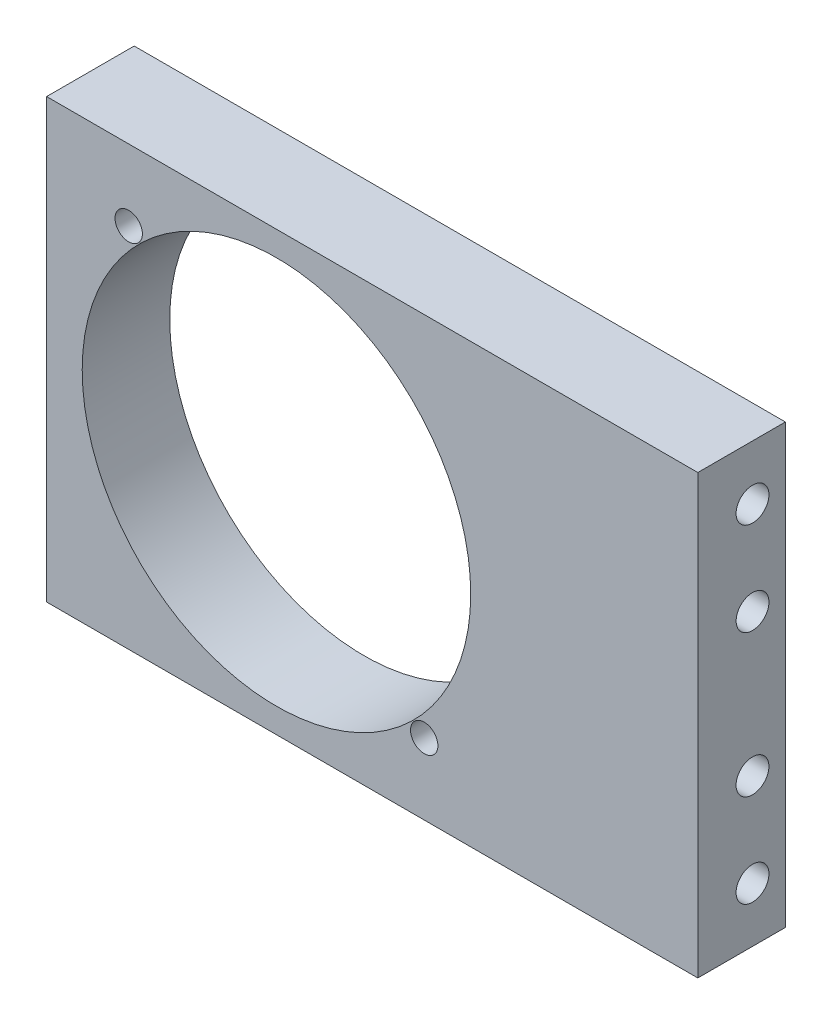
ISO-10303-21;
HEADER;
FILE_DESCRIPTION(('STEP AP214'),'2;1');
FILE_NAME('part.step','',(''),(''),'','','');
FILE_SCHEMA(('AUTOMOTIVE_DESIGN { 1 0 10303 214 1 1 1 1 }'));
ENDSEC;
DATA;
#1=APPLICATION_CONTEXT('core data for automotive mechanical design processes');
#2=APPLICATION_PROTOCOL_DEFINITION('international standard','automotive_design',2000,#1);
#3=PRODUCT_CONTEXT('',#1,'mechanical');
#4=PRODUCT('Part','Part','',(#3));
#5=PRODUCT_RELATED_PRODUCT_CATEGORY('part','',(#4));
#6=PRODUCT_DEFINITION_FORMATION('','',#4);
#7=PRODUCT_DEFINITION_CONTEXT('part definition',#1,'design');
#8=PRODUCT_DEFINITION('design','',#6,#7);
#9=PRODUCT_DEFINITION_SHAPE('','',#8);
#10=(LENGTH_UNIT() NAMED_UNIT(*) SI_UNIT(.MILLI.,.METRE.));
#11=(NAMED_UNIT(*) PLANE_ANGLE_UNIT() SI_UNIT($,.RADIAN.));
#12=(NAMED_UNIT(*) SI_UNIT($,.STERADIAN.) SOLID_ANGLE_UNIT());
#13=UNCERTAINTY_MEASURE_WITH_UNIT(LENGTH_MEASURE(1.E-05),#10,'distance_accuracy_value','');
#14=(GEOMETRIC_REPRESENTATION_CONTEXT(3) GLOBAL_UNCERTAINTY_ASSIGNED_CONTEXT((#13)) GLOBAL_UNIT_ASSIGNED_CONTEXT((#10,
#11,#12)) REPRESENTATION_CONTEXT('',''));
#15=CARTESIAN_POINT('',(0.,0.,0.));
#16=DIRECTION('',(0.,0.,1.));
#17=DIRECTION('',(1.,0.,0.));
#18=AXIS2_PLACEMENT_3D('',#15,#16,#17);
#19=CARTESIAN_POINT('',(0.,0.,8.00000000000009));
#20=DIRECTION('',(0.,0.,-1.00000000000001));
#21=DIRECTION('',(-1.,0.,0.));
#22=AXIS2_PLACEMENT_3D('',#19,#20,#21);
#23=PLANE('',#22);
#24=CARTESIAN_POINT('',(34.5,6.50000000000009,8.00000000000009));
#25=DIRECTION('',(0.,0.,1.));
#26=DIRECTION('',(1.,0.,0.));
#27=AXIS2_PLACEMENT_3D('',#24,#25,#26);
#28=CIRCLE('',#27,1.25);
#29=CARTESIAN_POINT('',(35.75,6.50000000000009,8.00000000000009));
#30=VERTEX_POINT('',#29);
#31=EDGE_CURVE('E416',#30,#30,#28,.T.);
#32=ORIENTED_EDGE('',*,*,#31,.F.);
#33=EDGE_LOOP('',(#32));
#34=FACE_BOUND('',#33,.T.);
#35=CARTESIAN_POINT('',(7.50000000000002,33.5000000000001,8.00000000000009));
#36=DIRECTION('',(0.,0.,1.));
#37=DIRECTION('',(1.,0.,0.));
#38=AXIS2_PLACEMENT_3D('',#35,#36,#37);
#39=CIRCLE('',#38,1.25);
#40=CARTESIAN_POINT('',(8.75000000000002,33.5000000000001,8.00000000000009));
#41=VERTEX_POINT('',#40);
#42=EDGE_CURVE('E99',#41,#41,#39,.T.);
#43=ORIENTED_EDGE('',*,*,#42,.F.);
#44=EDGE_LOOP('',(#43));
#45=FACE_BOUND('',#44,.T.);
#46=DIRECTION('',(0.,-1.00000000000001,0.));
#47=VECTOR('',#46,1.);
#48=CARTESIAN_POINT('',(0.,0.,8.00000000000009));
#49=LINE('',#48,#47);
#50=CARTESIAN_POINT('',(0.,40.0000000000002,8.00000000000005));
#51=VERTEX_POINT('',#50);
#52=CARTESIAN_POINT('',(0.,0.,8.00000000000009));
#53=VERTEX_POINT('',#52);
#54=EDGE_CURVE('E133',#51,#53,#49,.T.);
#55=ORIENTED_EDGE('',*,*,#54,.T.);
#56=DIRECTION('',(1.,0.,0.));
#57=VECTOR('',#56,1.);
#58=CARTESIAN_POINT('',(0.,0.,8.00000000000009));
#59=LINE('',#58,#57);
#60=CARTESIAN_POINT('',(59.5,0.,8.00000000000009));
#61=VERTEX_POINT('',#60);
#62=EDGE_CURVE('E135',#53,#61,#59,.T.);
#63=ORIENTED_EDGE('',*,*,#62,.T.);
#64=DIRECTION('',(0.,1.00000000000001,0.));
#65=VECTOR('',#64,1.);
#66=CARTESIAN_POINT('',(59.5,0.,8.00000000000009));
#67=LINE('',#66,#65);
#68=CARTESIAN_POINT('',(59.5,40.0000000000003,8.00000000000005));
#69=VERTEX_POINT('',#68);
#70=EDGE_CURVE('E137',#61,#69,#67,.T.);
#71=ORIENTED_EDGE('',*,*,#70,.T.);
#72=DIRECTION('',(-1.,0.,0.));
#73=VECTOR('',#72,1.);
#74=CARTESIAN_POINT('',(0.,40.0000000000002,8.00000000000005));
#75=LINE('',#74,#73);
#76=EDGE_CURVE('E49',#69,#51,#75,.T.);
#77=ORIENTED_EDGE('',*,*,#76,.T.);
#78=EDGE_LOOP('',(#55,#63,#71,#77));
#79=FACE_BOUND('',#78,.T.);
#80=CARTESIAN_POINT('',(21.,20.0000000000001,8.00000000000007));
#81=DIRECTION('',(0.,0.,1.00000000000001));
#82=DIRECTION('',(1.,0.,0.));
#83=AXIS2_PLACEMENT_3D('',#80,#81,#82);
#84=CIRCLE('',#83,17.75);
#85=CARTESIAN_POINT('',(38.75,20.0000000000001,8.00000000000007));
#86=VERTEX_POINT('',#85);
#87=EDGE_CURVE('E121',#86,#86,#84,.T.);
#88=ORIENTED_EDGE('',*,*,#87,.F.);
#89=EDGE_LOOP('',(#88));
#90=FACE_BOUND('',#89,.T.);
#91=ADVANCED_FACE('F27',(#34,#45,#79,#90),#23,.F.);
#92=CARTESIAN_POINT('',(0.,0.,0.));
#93=DIRECTION('',(0.,0.,-1.00000000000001));
#94=DIRECTION('',(-1.,0.,0.));
#95=AXIS2_PLACEMENT_3D('',#92,#93,#94);
#96=PLANE('',#95);
#97=CARTESIAN_POINT('',(34.5,6.50000000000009,0.));
#98=DIRECTION('',(0.,0.,-1.00000000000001));
#99=DIRECTION('',(-1.,0.,0.));
#100=AXIS2_PLACEMENT_3D('',#97,#98,#99);
#101=CIRCLE('',#100,1.25);
#102=CARTESIAN_POINT('',(33.25,6.50000000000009,0.));
#103=VERTEX_POINT('',#102);
#104=EDGE_CURVE('E31',#103,#103,#101,.T.);
#105=ORIENTED_EDGE('',*,*,#104,.F.);
#106=EDGE_LOOP('',(#105));
#107=FACE_BOUND('',#106,.T.);
#108=CARTESIAN_POINT('',(7.50000000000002,33.5000000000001,0.));
#109=DIRECTION('',(0.,0.,-1.00000000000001));
#110=DIRECTION('',(-1.,0.,0.));
#111=AXIS2_PLACEMENT_3D('',#108,#109,#110);
#112=CIRCLE('',#111,1.25);
#113=CARTESIAN_POINT('',(6.25000000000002,33.5000000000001,0.));
#114=VERTEX_POINT('',#113);
#115=EDGE_CURVE('E98',#114,#114,#112,.T.);
#116=ORIENTED_EDGE('',*,*,#115,.F.);
#117=EDGE_LOOP('',(#116));
#118=FACE_BOUND('',#117,.T.);
#119=DIRECTION('',(0.,-1.00000000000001,0.));
#120=VECTOR('',#119,1.);
#121=CARTESIAN_POINT('',(0.,0.,0.));
#122=LINE('',#121,#120);
#123=CARTESIAN_POINT('',(0.,40.0000000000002,0.));
#124=VERTEX_POINT('',#123);
#125=CARTESIAN_POINT('',(0.,0.,0.));
#126=VERTEX_POINT('',#125);
#127=EDGE_CURVE('E124',#124,#126,#122,.T.);
#128=ORIENTED_EDGE('',*,*,#127,.F.);
#129=DIRECTION('',(-1.,0.,0.));
#130=VECTOR('',#129,1.);
#131=CARTESIAN_POINT('',(0.,40.0000000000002,0.));
#132=LINE('',#131,#130);
#133=CARTESIAN_POINT('',(59.5,40.0000000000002,0.));
#134=VERTEX_POINT('',#133);
#135=EDGE_CURVE('E131',#134,#124,#132,.T.);
#136=ORIENTED_EDGE('',*,*,#135,.F.);
#137=DIRECTION('',(0.,1.00000000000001,0.));
#138=VECTOR('',#137,1.);
#139=CARTESIAN_POINT('',(59.5,0.,0.));
#140=LINE('',#139,#138);
#141=CARTESIAN_POINT('',(59.5,0.,0.));
#142=VERTEX_POINT('',#141);
#143=EDGE_CURVE('E129',#142,#134,#140,.T.);
#144=ORIENTED_EDGE('',*,*,#143,.F.);
#145=DIRECTION('',(1.,0.,0.));
#146=VECTOR('',#145,1.);
#147=CARTESIAN_POINT('',(0.,0.,0.));
#148=LINE('',#147,#146);
#149=EDGE_CURVE('E127',#126,#142,#148,.T.);
#150=ORIENTED_EDGE('',*,*,#149,.F.);
#151=EDGE_LOOP('',(#128,#136,#144,#150));
#152=FACE_BOUND('',#151,.T.);
#153=CARTESIAN_POINT('',(21.,20.0000000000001,0.));
#154=DIRECTION('',(0.,0.,1.00000000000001));
#155=DIRECTION('',(1.,0.,0.));
#156=AXIS2_PLACEMENT_3D('',#153,#154,#155);
#157=CIRCLE('',#156,17.75);
#158=CARTESIAN_POINT('',(38.75,20.0000000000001,0.));
#159=VERTEX_POINT('',#158);
#160=EDGE_CURVE('E118',#159,#159,#157,.T.);
#161=ORIENTED_EDGE('',*,*,#160,.T.);
#162=EDGE_LOOP('',(#161));
#163=FACE_BOUND('',#162,.T.);
#164=ADVANCED_FACE('F190',(#107,#118,#152,#163),#96,.T.);
#165=CARTESIAN_POINT('',(0.,0.,8.00000000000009));
#166=DIRECTION('',(1.,0.,0.));
#167=DIRECTION('',(0.,0.,-1.00000000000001));
#168=AXIS2_PLACEMENT_3D('',#165,#166,#167);
#169=PLANE('',#168);
#170=CARTESIAN_POINT('',(0.,5.,3.00000000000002));
#171=DIRECTION('',(-1.,0.,0.));
#172=DIRECTION('',(0.,0.,1.00000000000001));
#173=AXIS2_PLACEMENT_3D('',#170,#171,#172);
#174=CIRCLE('',#173,1.5);
#175=CARTESIAN_POINT('',(0.,5.,4.50000000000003));
#176=VERTEX_POINT('',#175);
#177=EDGE_CURVE('E103',#176,#176,#174,.T.);
#178=ORIENTED_EDGE('',*,*,#177,.F.);
#179=EDGE_LOOP('',(#178));
#180=FACE_BOUND('',#179,.T.);
#181=CARTESIAN_POINT('',(0.,35.0000000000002,3.));
#182=DIRECTION('',(-1.,0.,0.));
#183=DIRECTION('',(0.,0.,1.00000000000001));
#184=AXIS2_PLACEMENT_3D('',#181,#182,#183);
#185=CIRCLE('',#184,1.5);
#186=CARTESIAN_POINT('',(0.,35.0000000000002,4.50000000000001));
#187=VERTEX_POINT('',#186);
#188=EDGE_CURVE('E115',#187,#187,#185,.T.);
#189=ORIENTED_EDGE('',*,*,#188,.F.);
#190=EDGE_LOOP('',(#189));
#191=FACE_BOUND('',#190,.T.);
#192=ORIENTED_EDGE('',*,*,#127,.T.);
#193=DIRECTION('',(0.,0.,-1.00000000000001));
#194=VECTOR('',#193,1.);
#195=CARTESIAN_POINT('',(0.,0.,8.00000000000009));
#196=LINE('',#195,#194);
#197=EDGE_CURVE('E36',#53,#126,#196,.T.);
#198=ORIENTED_EDGE('',*,*,#197,.F.);
#199=ORIENTED_EDGE('',*,*,#54,.F.);
#200=DIRECTION('',(0.,0.,-1.00000000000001));
#201=VECTOR('',#200,1.);
#202=CARTESIAN_POINT('',(0.,40.0000000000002,8.00000000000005));
#203=LINE('',#202,#201);
#204=EDGE_CURVE('E140',#51,#124,#203,.T.);
#205=ORIENTED_EDGE('',*,*,#204,.T.);
#206=EDGE_LOOP('',(#192,#198,#199,#205));
#207=FACE_BOUND('',#206,.T.);
#208=ADVANCED_FACE('F29',(#180,#191,#207),#169,.F.);
#209=CARTESIAN_POINT('',(0.,0.,8.00000000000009));
#210=DIRECTION('',(0.,1.00000000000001,0.));
#211=DIRECTION('',(0.,0.,1.00000000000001));
#212=AXIS2_PLACEMENT_3D('',#209,#210,#211);
#213=PLANE('',#212);
#214=ORIENTED_EDGE('',*,*,#149,.T.);
#215=DIRECTION('',(0.,0.,-1.00000000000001));
#216=VECTOR('',#215,1.);
#217=CARTESIAN_POINT('',(59.5,0.,8.00000000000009));
#218=LINE('',#217,#216);
#219=EDGE_CURVE('E146',#61,#142,#218,.T.);
#220=ORIENTED_EDGE('',*,*,#219,.F.);
#221=ORIENTED_EDGE('',*,*,#62,.F.);
#222=ORIENTED_EDGE('',*,*,#197,.T.);
#223=EDGE_LOOP('',(#214,#220,#221,#222));
#224=FACE_BOUND('',#223,.T.);
#225=ADVANCED_FACE('F202',(#224),#213,.F.);
#226=CARTESIAN_POINT('',(59.5,0.,8.00000000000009));
#227=DIRECTION('',(-1.,0.,0.));
#228=DIRECTION('',(0.,0.,1.00000000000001));
#229=AXIS2_PLACEMENT_3D('',#226,#227,#228);
#230=PLANE('',#229);
#231=CARTESIAN_POINT('',(59.5,13.4999987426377,3.0046233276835));
#232=DIRECTION('',(1.,0.,0.));
#233=DIRECTION('',(0.,0.,-1.00000000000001));
#234=AXIS2_PLACEMENT_3D('',#231,#232,#233);
#235=CIRCLE('',#234,1.49999999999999);
#236=CARTESIAN_POINT('',(59.5,13.4999987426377,1.5046233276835));
#237=VERTEX_POINT('',#236);
#238=EDGE_CURVE('E326',#237,#237,#235,.T.);
#239=ORIENTED_EDGE('',*,*,#238,.F.);
#240=EDGE_LOOP('',(#239));
#241=FACE_BOUND('',#240,.T.);
#242=CARTESIAN_POINT('',(59.5,26.5000000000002,3.00000000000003));
#243=DIRECTION('',(1.,0.,0.));
#244=DIRECTION('',(0.,0.,-1.00000000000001));
#245=AXIS2_PLACEMENT_3D('',#242,#243,#244);
#246=CIRCLE('',#245,1.49999999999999);
#247=CARTESIAN_POINT('',(59.5,26.5000000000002,1.50000000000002));
#248=VERTEX_POINT('',#247);
#249=EDGE_CURVE('E340',#248,#248,#246,.T.);
#250=ORIENTED_EDGE('',*,*,#249,.F.);
#251=EDGE_LOOP('',(#250));
#252=FACE_BOUND('',#251,.T.);
#253=CARTESIAN_POINT('',(59.5,35.0000000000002,3.));
#254=DIRECTION('',(-1.,0.,0.));
#255=DIRECTION('',(0.,0.,1.00000000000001));
#256=AXIS2_PLACEMENT_3D('',#253,#254,#255);
#257=CIRCLE('',#256,1.5);
#258=CARTESIAN_POINT('',(59.5,35.0000000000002,4.50000000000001));
#259=VERTEX_POINT('',#258);
#260=EDGE_CURVE('E343',#259,#259,#257,.T.);
#261=ORIENTED_EDGE('',*,*,#260,.T.);
#262=EDGE_LOOP('',(#261));
#263=FACE_BOUND('',#262,.T.);
#264=CARTESIAN_POINT('',(59.5,5.,3.00000000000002));
#265=DIRECTION('',(-1.,0.,0.));
#266=DIRECTION('',(0.,0.,1.00000000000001));
#267=AXIS2_PLACEMENT_3D('',#264,#265,#266);
#268=CIRCLE('',#267,1.5);
#269=CARTESIAN_POINT('',(59.5,5.,4.50000000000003));
#270=VERTEX_POINT('',#269);
#271=EDGE_CURVE('E355',#270,#270,#268,.T.);
#272=ORIENTED_EDGE('',*,*,#271,.T.);
#273=EDGE_LOOP('',(#272));
#274=FACE_BOUND('',#273,.T.);
#275=ORIENTED_EDGE('',*,*,#143,.T.);
#276=DIRECTION('',(0.,0.,-1.00000000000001));
#277=VECTOR('',#276,1.);
#278=CARTESIAN_POINT('',(59.5,40.0000000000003,8.00000000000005));
#279=LINE('',#278,#277);
#280=EDGE_CURVE('E143',#69,#134,#279,.T.);
#281=ORIENTED_EDGE('',*,*,#280,.F.);
#282=ORIENTED_EDGE('',*,*,#70,.F.);
#283=ORIENTED_EDGE('',*,*,#219,.T.);
#284=EDGE_LOOP('',(#275,#281,#282,#283));
#285=FACE_BOUND('',#284,.T.);
#286=ADVANCED_FACE('F199',(#241,#252,#263,#274,#285),#230,.F.);
#287=CARTESIAN_POINT('',(0.,40.0000000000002,8.00000000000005));
#288=DIRECTION('',(0.,-1.00000000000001,0.));
#289=DIRECTION('',(1.,0.,0.));
#290=AXIS2_PLACEMENT_3D('',#287,#288,#289);
#291=PLANE('',#290);
#292=ORIENTED_EDGE('',*,*,#135,.T.);
#293=ORIENTED_EDGE('',*,*,#204,.F.);
#294=ORIENTED_EDGE('',*,*,#76,.F.);
#295=ORIENTED_EDGE('',*,*,#280,.T.);
#296=EDGE_LOOP('',(#292,#293,#294,#295));
#297=FACE_BOUND('',#296,.T.);
#298=ADVANCED_FACE('F188',(#297),#291,.F.);
#299=CARTESIAN_POINT('',(21.,20.0000000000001,8.00000000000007));
#300=DIRECTION('',(0.,0.,-1.00000000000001));
#301=DIRECTION('',(-1.,0.,0.));
#302=AXIS2_PLACEMENT_3D('',#299,#300,#301);
#303=CYLINDRICAL_SURFACE('',#302,17.75);
#304=ORIENTED_EDGE('',*,*,#87,.T.);
#305=EDGE_LOOP('',(#304));
#306=FACE_BOUND('',#305,.T.);
#307=ORIENTED_EDGE('',*,*,#160,.F.);
#308=EDGE_LOOP('',(#307));
#309=FACE_BOUND('',#308,.T.);
#310=ADVANCED_FACE('F184',(#306,#309),#303,.F.);
#311=CARTESIAN_POINT('',(0.,35.0000000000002,3.));
#312=DIRECTION('',(-1.,0.,0.));
#313=DIRECTION('',(0.,0.,1.00000000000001));
#314=AXIS2_PLACEMENT_3D('',#311,#312,#313);
#315=CYLINDRICAL_SURFACE('',#314,1.5);
#316=CARTESIAN_POINT('',(5.,35.0000000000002,3.));
#317=DIRECTION('',(-1.,0.,0.));
#318=DIRECTION('',(0.,0.,1.00000000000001));
#319=AXIS2_PLACEMENT_3D('',#316,#317,#318);
#320=CIRCLE('',#319,1.5);
#321=CARTESIAN_POINT('',(5.,35.0000000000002,4.50000000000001));
#322=VERTEX_POINT('',#321);
#323=EDGE_CURVE('E106',#322,#322,#320,.T.);
#324=ORIENTED_EDGE('',*,*,#323,.F.);
#325=EDGE_LOOP('',(#324));
#326=FACE_BOUND('',#325,.T.);
#327=ORIENTED_EDGE('',*,*,#188,.T.);
#328=EDGE_LOOP('',(#327));
#329=FACE_BOUND('',#328,.T.);
#330=ADVANCED_FACE('F180',(#326,#329),#315,.F.);
#331=CARTESIAN_POINT('',(5.,36.2500000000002,3.00000000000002));
#332=DIRECTION('',(1.,0.,0.));
#333=DIRECTION('',(0.,0.,-1.00000000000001));
#334=AXIS2_PLACEMENT_3D('',#331,#332,#333);
#335=PLANE('',#334);
#336=CARTESIAN_POINT('',(5.,35.0000000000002,3.));
#337=DIRECTION('',(-1.,0.,0.));
#338=DIRECTION('',(0.,0.,1.00000000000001));
#339=AXIS2_PLACEMENT_3D('',#336,#337,#338);
#340=CIRCLE('',#339,1.25);
#341=CARTESIAN_POINT('',(5.,35.0000000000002,4.25000000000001));
#342=VERTEX_POINT('',#341);
#343=EDGE_CURVE('E102',#342,#342,#340,.T.);
#344=ORIENTED_EDGE('',*,*,#343,.F.);
#345=EDGE_LOOP('',(#344));
#346=FACE_BOUND('',#345,.T.);
#347=ORIENTED_EDGE('',*,*,#323,.T.);
#348=EDGE_LOOP('',(#347));
#349=FACE_BOUND('',#348,.T.);
#350=ADVANCED_FACE('F177',(#346,#349),#335,.F.);
#351=CARTESIAN_POINT('',(0.,35.0000000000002,3.));
#352=DIRECTION('',(-1.,0.,0.));
#353=DIRECTION('',(0.,0.,1.00000000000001));
#354=AXIS2_PLACEMENT_3D('',#351,#352,#353);
#355=CYLINDRICAL_SURFACE('',#354,1.25);
#356=CARTESIAN_POINT('',(7.49999999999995,35.0000000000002,3.));
#357=DIRECTION('',(-1.,0.,0.));
#358=DIRECTION('',(0.,0.,1.00000000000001));
#359=AXIS2_PLACEMENT_3D('',#356,#357,#358);
#360=CIRCLE('',#359,1.25);
#361=CARTESIAN_POINT('',(7.49999999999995,34.7500000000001,4.22474487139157));
#362=VERTEX_POINT('',#361);
#363=CARTESIAN_POINT('',(7.49999999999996,34.7500000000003,1.77525512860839));
#364=VERTEX_POINT('',#363);
#365=EDGE_CURVE('E97',#362,#364,#360,.T.);
#366=ORIENTED_EDGE('',*,*,#365,.F.);
#367=CARTESIAN_POINT('',(7.49999999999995,34.7500000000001,4.22474487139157));
#368=CARTESIAN_POINT('',(7.46650399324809,34.750003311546,4.22473581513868));
#369=CARTESIAN_POINT('',(7.43300870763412,34.7486536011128,4.22446977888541));
#370=CARTESIAN_POINT('',(7.36623995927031,34.7432731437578,4.22335815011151));
#371=CARTESIAN_POINT('',(7.33296652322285,34.7392420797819,4.22251248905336));
#372=CARTESIAN_POINT('',(7.26677348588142,34.728508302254,4.22017257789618));
#373=CARTESIAN_POINT('',(7.23385519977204,34.7217978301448,4.21867644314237));
#374=CARTESIAN_POINT('',(7.16871640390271,34.7057687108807,4.2149052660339));
#375=CARTESIAN_POINT('',(7.13649586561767,34.6964501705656,4.21263025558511));
#376=CARTESIAN_POINT('',(7.04111563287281,34.6646491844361,4.20437957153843));
#377=CARTESIAN_POINT('',(6.9792945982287,34.6383307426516,4.196979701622));
#378=CARTESIAN_POINT('',(6.86146135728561,34.5766530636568,4.17657240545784));
#379=CARTESIAN_POINT('',(6.80543988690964,34.5413085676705,4.16357409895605));
#380=CARTESIAN_POINT('',(6.70378964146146,34.4655833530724,4.13071051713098));
#381=CARTESIAN_POINT('',(6.65777287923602,34.4255582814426,4.11123576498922));
#382=CARTESIAN_POINT('',(6.57415937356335,34.3419078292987,4.06381831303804));
#383=CARTESIAN_POINT('',(6.53655445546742,34.2982860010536,4.03588389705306));
#384=CARTESIAN_POINT('',(6.47430255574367,34.2160946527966,3.97483139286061));
#385=CARTESIAN_POINT('',(6.448649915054,34.1775366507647,3.94271461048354));
#386=CARTESIAN_POINT('',(6.4040490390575,34.1027360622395,3.87182060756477));
#387=CARTESIAN_POINT('',(6.38510231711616,34.0664939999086,3.83304188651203));
#388=CARTESIAN_POINT('',(6.3532557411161,33.9988584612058,3.75035302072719));
#389=CARTESIAN_POINT('',(6.34027075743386,33.9674013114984,3.70652707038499));
#390=CARTESIAN_POINT('',(6.31877299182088,33.9100517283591,3.61437958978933));
#391=CARTESIAN_POINT('',(6.31026181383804,33.8841612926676,3.56605645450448));
#392=CARTESIAN_POINT('',(6.29583428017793,33.8364157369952,3.46071751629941));
#393=CARTESIAN_POINT('',(6.290290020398,33.815282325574,3.40332375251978));
#394=CARTESIAN_POINT('',(6.28200757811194,33.7815937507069,3.285875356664));
#395=CARTESIAN_POINT('',(6.2792706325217,33.7690423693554,3.22581956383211));
#396=CARTESIAN_POINT('',(6.27565084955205,33.7521029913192,3.09869967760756));
#397=CARTESIAN_POINT('',(6.274968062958,33.748600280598,3.03151033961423));
#398=CARTESIAN_POINT('',(6.27574856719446,33.7524096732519,2.89743509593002));
#399=CARTESIAN_POINT('',(6.27721259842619,33.7597255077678,2.83054930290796));
#400=CARTESIAN_POINT('',(6.28291581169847,33.7852761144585,2.6972370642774));
#401=CARTESIAN_POINT('',(6.28722440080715,33.8037829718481,2.63086524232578));
#402=CARTESIAN_POINT('',(6.30012115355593,33.851273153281,2.50239475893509));
#403=CARTESIAN_POINT('',(6.30870892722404,33.8802555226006,2.44029570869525));
#404=CARTESIAN_POINT('',(6.33183332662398,33.9461590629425,2.32457986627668));
#405=CARTESIAN_POINT('',(6.34615057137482,33.9827658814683,2.27074185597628));
#406=CARTESIAN_POINT('',(6.38274484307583,34.0622623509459,2.17102663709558));
#407=CARTESIAN_POINT('',(6.4050101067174,34.1051426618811,2.12513781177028));
#408=CARTESIAN_POINT('',(6.45590332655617,34.1888220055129,2.04743551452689));
#409=CARTESIAN_POINT('',(6.4835192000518,34.2293027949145,2.01461465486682));
#410=CARTESIAN_POINT('',(6.54641322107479,34.3097988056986,1.95664783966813));
#411=CARTESIAN_POINT('',(6.58169003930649,34.3498141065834,1.93150055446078));
#412=CARTESIAN_POINT('',(6.65656224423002,34.4239556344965,1.88988343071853));
#413=CARTESIAN_POINT('',(6.69567771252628,34.458298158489,1.87292675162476));
#414=CARTESIAN_POINT('',(6.77911396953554,34.5225449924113,1.84424182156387));
#415=CARTESIAN_POINT('',(6.82343648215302,34.5524478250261,1.83251530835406));
#416=CARTESIAN_POINT('',(6.91960260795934,34.6085854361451,1.81246033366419));
#417=CARTESIAN_POINT('',(6.97175905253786,34.6343932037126,1.80444235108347));
#418=CARTESIAN_POINT('',(7.07951886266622,34.6785975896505,1.79180675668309));
#419=CARTESIAN_POINT('',(7.1351239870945,34.6969903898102,1.78719089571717));
#420=CARTESIAN_POINT('',(7.24209796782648,34.7242057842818,1.78073402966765));
#421=CARTESIAN_POINT('',(7.29323756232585,34.7338736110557,1.7786388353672));
#422=CARTESIAN_POINT('',(7.37050713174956,34.7435455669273,1.77658652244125));
#423=CARTESIAN_POINT('',(7.39634106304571,34.7459645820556,1.77608413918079));
#424=CARTESIAN_POINT('',(7.4481145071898,34.7491919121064,1.77541978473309));
#425=CARTESIAN_POINT('',(7.47405402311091,34.7500001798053,1.7752578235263));
#426=CARTESIAN_POINT('',(7.49999999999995,34.7500000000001,1.77525512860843));
#427=B_SPLINE_CURVE_WITH_KNOTS('',3,(#367,#368,#369,#370,#371,#372,#373,#374,#375,#376,#377,
#378,#379,#380,#381,#382,#383,#384,#385,#386,#387,#388,#389,#390,#391,#392,#393,#394,#395,#396,
#397,#398,#399,#400,#401,#402,#403,#404,#405,#406,#407,#408,#409,#410,#411,#412,#413,#414,#415,
#416,#417,#418,#419,#420,#421,#422,#423,#424,#425,#426),.UNSPECIFIED.,.F.,.F.,(4,2,2,2,2,2,2,2,
2,2,2,2,2,2,2,2,2,2,2,2,2,2,2,2,2,2,2,2,2,4),(0.,0.100458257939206,0.200928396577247,
0.301691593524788,0.402450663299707,0.604140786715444,0.805503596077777,0.996437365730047,
1.18718477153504,1.35541307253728,1.52367931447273,1.68946177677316,1.85530363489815,
2.03877796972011,2.22233310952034,2.42326485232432,2.62426590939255,2.83036218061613,
3.03643967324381,3.2352839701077,3.43383518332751,3.60979711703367,3.78572854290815,
3.94925444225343,4.11283463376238,4.28835395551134,4.46396354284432,4.61977278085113,
4.6975823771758,4.77539425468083),.UNSPECIFIED.);
#428=EDGE_CURVE('E42',#362,#364,#427,.T.);
#429=ORIENTED_EDGE('',*,*,#428,.T.);
#430=EDGE_LOOP('',(#366,#429));
#431=FACE_BOUND('',#430,.T.);
#432=ORIENTED_EDGE('',*,*,#343,.T.);
#433=EDGE_LOOP('',(#432));
#434=FACE_BOUND('',#433,.T.);
#435=ADVANCED_FACE('F95',(#431,#434),#355,.F.);
#436=CARTESIAN_POINT('',(7.49999999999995,35.0000000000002,3.));
#437=DIRECTION('',(-1.,0.,0.));
#438=DIRECTION('',(0.,0.,1.00000000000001));
#439=AXIS2_PLACEMENT_3D('',#436,#437,#438);
#440=CONICAL_SURFACE('',#439,1.25,1.0471975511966);
#441=CARTESIAN_POINT('',(8.22168783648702,35.0000000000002,3.));
#442=VERTEX_POINT('',#441);
#443=VERTEX_LOOP('',#442);
#444=FACE_BOUND('',#443,.T.);
#445=ORIENTED_EDGE('',*,*,#365,.T.);
#446=CARTESIAN_POINT('',(7.42763121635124,34.747903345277,1.64795524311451));
#447=CARTESIAN_POINT('',(7.45993917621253,34.7497821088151,1.70457335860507));
#448=CARTESIAN_POINT('',(7.49216370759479,34.7503869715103,1.76127895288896));
#449=CARTESIAN_POINT('',(7.55620829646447,34.7491450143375,1.87490263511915));
#450=CARTESIAN_POINT('',(7.58802829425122,34.7472978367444,1.93182075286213));
#451=CARTESIAN_POINT('',(7.65123686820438,34.7412262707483,2.04628935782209));
#452=CARTESIAN_POINT('',(7.68262087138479,34.7369853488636,2.1038414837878));
#453=CARTESIAN_POINT('',(7.74425771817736,34.7262999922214,2.21933523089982));
#454=CARTESIAN_POINT('',(7.77451077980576,34.7198559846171,2.27727677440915));
#455=CARTESIAN_POINT('',(7.8203043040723,34.7083867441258,2.3686780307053));
#456=CARTESIAN_POINT('',(7.83653888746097,34.7039569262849,2.40186531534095));
#457=CARTESIAN_POINT('',(7.8680558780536,34.6946981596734,2.46863214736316));
#458=CARTESIAN_POINT('',(7.88333838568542,34.6898692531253,2.50221165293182));
#459=CARTESIAN_POINT('',(7.91251122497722,34.6800723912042,2.56994327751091));
#460=CARTESIAN_POINT('',(7.92640219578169,34.6751045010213,2.60409512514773));
#461=CARTESIAN_POINT('',(7.95211863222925,34.6654512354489,2.67319037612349));
#462=CARTESIAN_POINT('',(7.9639451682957,34.6607657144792,2.70813335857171));
#463=CARTESIAN_POINT('',(7.98727956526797,34.6511990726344,2.78857101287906));
#464=CARTESIAN_POINT('',(7.99786349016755,34.6465982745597,2.83439712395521));
#465=CARTESIAN_POINT('',(8.00811657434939,34.6420733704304,2.90393877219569));
#466=CARTESIAN_POINT('',(8.01059827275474,34.6409608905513,2.92715908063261));
#467=CARTESIAN_POINT('',(8.01351708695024,34.6396503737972,2.97375773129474));
#468=CARTESIAN_POINT('',(8.01395439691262,34.6394522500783,2.99713605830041));
#469=CARTESIAN_POINT('',(8.01274246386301,34.6399980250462,3.04375150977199));
#470=CARTESIAN_POINT('',(8.01109977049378,34.6407389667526,3.06698884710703));
#471=CARTESIAN_POINT('',(8.00588960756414,34.6430588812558,3.11320631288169));
#472=CARTESIAN_POINT('',(8.00232136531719,34.6446381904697,3.13618633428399));
#473=CARTESIAN_POINT('',(7.99345239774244,34.648489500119,3.18220677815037));
#474=CARTESIAN_POINT('',(7.98811945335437,34.6507743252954,3.20523974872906));
#475=CARTESIAN_POINT('',(7.9760666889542,34.6558129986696,3.25088159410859));
#476=CARTESIAN_POINT('',(7.96934674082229,34.6585668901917,3.27349042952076));
#477=CARTESIAN_POINT('',(7.94604504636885,34.6678339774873,3.34546019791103));
#478=CARTESIAN_POINT('',(7.92737403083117,34.6748617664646,3.39406847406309));
#479=CARTESIAN_POINT('',(7.88706284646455,34.6887567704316,3.49007553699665));
#480=CARTESIAN_POINT('',(7.8654186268,34.6956237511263,3.5374725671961));
#481=CARTESIAN_POINT('',(7.82030423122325,34.7084944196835,3.63173151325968));
#482=CARTESIAN_POINT('',(7.79682744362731,34.7144947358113,3.67859071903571));
#483=CARTESIAN_POINT('',(7.74880379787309,34.7252360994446,3.77190356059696));
#484=CARTESIAN_POINT('',(7.72425686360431,34.7299770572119,3.8183571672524));
#485=CARTESIAN_POINT('',(7.67735065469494,34.7375560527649,3.9056864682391));
#486=CARTESIAN_POINT('',(7.65506511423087,34.7405503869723,3.94658826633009));
#487=CARTESIAN_POINT('',(7.61012555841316,34.7453446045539,4.0282676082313));
#488=CARTESIAN_POINT('',(7.58747148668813,34.7471443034,4.06904513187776));
#489=CARTESIAN_POINT('',(7.54204729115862,34.7494984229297,4.15025459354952));
#490=CARTESIAN_POINT('',(7.51927865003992,34.7500601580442,4.19068714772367));
#491=CARTESIAN_POINT('',(7.47356788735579,34.7499296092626,4.27144487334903));
#492=CARTESIAN_POINT('',(7.45062578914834,34.7492374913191,4.31177005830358));
#493=CARTESIAN_POINT('',(7.42763121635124,34.747903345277,4.35204475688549));
#494=B_SPLINE_CURVE_WITH_KNOTS('',3,(#446,#447,#448,#449,#450,#451,#452,#453,#454,#455,#456,
#457,#458,#459,#460,#461,#462,#463,#464,#465,#466,#467,#468,#469,#470,#471,#472,#473,#474,#475,
#476,#477,#478,#479,#480,#481,#482,#483,#484,#485,#486,#487,#488,#489,#490,#491,#492,#493),
.UNSPECIFIED.,.F.,.F.,(4,2,2,2,2,2,2,2,2,2,2,2,2,2,2,2,2,2,2,2,2,2,2,4),(0.,0.195628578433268,
0.391285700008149,0.588311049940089,0.78529822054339,0.896915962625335,1.00852191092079,
1.1200763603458,1.23157279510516,1.37276723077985,1.44280909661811,1.51284430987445,
1.58265953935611,1.65250280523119,1.72369892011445,1.79490161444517,1.95231326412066,
2.10994154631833,2.26816744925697,2.42640462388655,2.5664133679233,2.70644373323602,
2.84564449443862,2.98482683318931),.UNSPECIFIED.);
#495=EDGE_CURVE('E11',#364,#362,#494,.T.);
#496=ORIENTED_EDGE('',*,*,#495,.T.);
#497=EDGE_LOOP('',(#445,#496));
#498=FACE_BOUND('',#497,.T.);
#499=ADVANCED_FACE('F101',(#444,#498),#440,.F.);
#500=CARTESIAN_POINT('',(0.,5.,3.00000000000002));
#501=DIRECTION('',(-1.,0.,0.));
#502=DIRECTION('',(0.,0.,1.00000000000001));
#503=AXIS2_PLACEMENT_3D('',#500,#501,#502);
#504=CYLINDRICAL_SURFACE('',#503,1.5);
#505=CARTESIAN_POINT('',(5.,5.,3.00000000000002));
#506=DIRECTION('',(-1.,0.,0.));
#507=DIRECTION('',(0.,0.,1.00000000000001));
#508=AXIS2_PLACEMENT_3D('',#505,#506,#507);
#509=CIRCLE('',#508,1.5);
#510=CARTESIAN_POINT('',(5.,5.,4.50000000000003));
#511=VERTEX_POINT('',#510);
#512=EDGE_CURVE('E109',#511,#511,#509,.T.);
#513=ORIENTED_EDGE('',*,*,#512,.F.);
#514=EDGE_LOOP('',(#513));
#515=FACE_BOUND('',#514,.T.);
#516=ORIENTED_EDGE('',*,*,#177,.T.);
#517=EDGE_LOOP('',(#516));
#518=FACE_BOUND('',#517,.T.);
#519=ADVANCED_FACE('F233',(#515,#518),#504,.F.);
#520=CARTESIAN_POINT('',(5.,6.25,3.00000000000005));
#521=DIRECTION('',(1.,0.,0.));
#522=DIRECTION('',(0.,0.,-1.00000000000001));
#523=AXIS2_PLACEMENT_3D('',#520,#521,#522);
#524=PLANE('',#523);
#525=CARTESIAN_POINT('',(5.,5.,3.00000000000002));
#526=DIRECTION('',(-1.,0.,0.));
#527=DIRECTION('',(0.,0.,1.00000000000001));
#528=AXIS2_PLACEMENT_3D('',#525,#526,#527);
#529=CIRCLE('',#528,1.25);
#530=CARTESIAN_POINT('',(5.,5.,4.25000000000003));
#531=VERTEX_POINT('',#530);
#532=EDGE_CURVE('E370',#531,#531,#529,.T.);
#533=ORIENTED_EDGE('',*,*,#532,.F.);
#534=EDGE_LOOP('',(#533));
#535=FACE_BOUND('',#534,.T.);
#536=ORIENTED_EDGE('',*,*,#512,.T.);
#537=EDGE_LOOP('',(#536));
#538=FACE_BOUND('',#537,.T.);
#539=ADVANCED_FACE('F235',(#535,#538),#524,.F.);
#540=CARTESIAN_POINT('',(0.,5.,3.00000000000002));
#541=DIRECTION('',(-1.,0.,0.));
#542=DIRECTION('',(0.,0.,1.00000000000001));
#543=AXIS2_PLACEMENT_3D('',#540,#541,#542);
#544=CYLINDRICAL_SURFACE('',#543,1.25);
#545=CARTESIAN_POINT('',(7.49999999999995,5.,3.00000000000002));
#546=DIRECTION('',(-1.,0.,0.));
#547=DIRECTION('',(0.,0.,1.00000000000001));
#548=AXIS2_PLACEMENT_3D('',#545,#546,#547);
#549=CIRCLE('',#548,1.25);
#550=CARTESIAN_POINT('',(7.49999999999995,5.,4.25000000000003));
#551=VERTEX_POINT('',#550);
#552=EDGE_CURVE('E367',#551,#551,#549,.T.);
#553=ORIENTED_EDGE('',*,*,#552,.F.);
#554=EDGE_LOOP('',(#553));
#555=FACE_BOUND('',#554,.T.);
#556=ORIENTED_EDGE('',*,*,#532,.T.);
#557=EDGE_LOOP('',(#556));
#558=FACE_BOUND('',#557,.T.);
#559=ADVANCED_FACE('F240',(#555,#558),#544,.F.);
#560=CARTESIAN_POINT('',(7.49999999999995,5.,3.00000000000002));
#561=DIRECTION('',(-1.,0.,0.));
#562=DIRECTION('',(0.,0.,1.00000000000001));
#563=AXIS2_PLACEMENT_3D('',#560,#561,#562);
#564=CONICAL_SURFACE('',#563,1.25,1.0471975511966);
#565=CARTESIAN_POINT('',(8.22168783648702,5.,3.00000000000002));
#566=VERTEX_POINT('',#565);
#567=VERTEX_LOOP('',#566);
#568=FACE_BOUND('',#567,.T.);
#569=ORIENTED_EDGE('',*,*,#552,.T.);
#570=EDGE_LOOP('',(#569));
#571=FACE_BOUND('',#570,.T.);
#572=ADVANCED_FACE('F249',(#568,#571),#564,.F.);
#573=CARTESIAN_POINT('',(59.5,5.,3.00000000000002));
#574=DIRECTION('',(1.,0.,0.));
#575=DIRECTION('',(0.,0.,1.00000000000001));
#576=AXIS2_PLACEMENT_3D('',#573,#574,#575);
#577=CYLINDRICAL_SURFACE('',#576,1.5);
#578=CARTESIAN_POINT('',(54.5,5.,3.00000000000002));
#579=DIRECTION('',(-1.,0.,0.));
#580=DIRECTION('',(0.,0.,1.00000000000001));
#581=AXIS2_PLACEMENT_3D('',#578,#579,#580);
#582=CIRCLE('',#581,1.5);
#583=CARTESIAN_POINT('',(54.5,5.,4.50000000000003));
#584=VERTEX_POINT('',#583);
#585=EDGE_CURVE('E364',#584,#584,#582,.T.);
#586=ORIENTED_EDGE('',*,*,#585,.T.);
#587=EDGE_LOOP('',(#586));
#588=FACE_BOUND('',#587,.T.);
#589=ORIENTED_EDGE('',*,*,#271,.F.);
#590=EDGE_LOOP('',(#589));
#591=FACE_BOUND('',#590,.T.);
#592=ADVANCED_FACE('F253',(#588,#591),#577,.F.);
#593=CARTESIAN_POINT('',(54.5,6.25000000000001,3.00000000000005));
#594=DIRECTION('',(-1.,0.,0.));
#595=DIRECTION('',(0.,0.,-1.00000000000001));
#596=AXIS2_PLACEMENT_3D('',#593,#594,#595);
#597=PLANE('',#596);
#598=CARTESIAN_POINT('',(54.5,5.,3.00000000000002));
#599=DIRECTION('',(-1.,0.,0.));
#600=DIRECTION('',(0.,0.,1.00000000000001));
#601=AXIS2_PLACEMENT_3D('',#598,#599,#600);
#602=CIRCLE('',#601,1.25);
#603=CARTESIAN_POINT('',(54.5,5.,4.25000000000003));
#604=VERTEX_POINT('',#603);
#605=EDGE_CURVE('E361',#604,#604,#602,.T.);
#606=ORIENTED_EDGE('',*,*,#605,.T.);
#607=EDGE_LOOP('',(#606));
#608=FACE_BOUND('',#607,.T.);
#609=ORIENTED_EDGE('',*,*,#585,.F.);
#610=EDGE_LOOP('',(#609));
#611=FACE_BOUND('',#610,.T.);
#612=ADVANCED_FACE('F257',(#608,#611),#597,.F.);
#613=CARTESIAN_POINT('',(59.5,5.,3.00000000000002));
#614=DIRECTION('',(1.,0.,0.));
#615=DIRECTION('',(0.,0.,1.00000000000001));
#616=AXIS2_PLACEMENT_3D('',#613,#614,#615);
#617=CYLINDRICAL_SURFACE('',#616,1.25);
#618=CARTESIAN_POINT('',(51.9999999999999,5.,3.00000000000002));
#619=DIRECTION('',(-1.,0.,0.));
#620=DIRECTION('',(0.,0.,1.00000000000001));
#621=AXIS2_PLACEMENT_3D('',#618,#619,#620);
#622=CIRCLE('',#621,1.25);
#623=CARTESIAN_POINT('',(51.9999999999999,5.,4.25000000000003));
#624=VERTEX_POINT('',#623);
#625=EDGE_CURVE('E358',#624,#624,#622,.T.);
#626=ORIENTED_EDGE('',*,*,#625,.T.);
#627=EDGE_LOOP('',(#626));
#628=FACE_BOUND('',#627,.T.);
#629=ORIENTED_EDGE('',*,*,#605,.F.);
#630=EDGE_LOOP('',(#629));
#631=FACE_BOUND('',#630,.T.);
#632=ADVANCED_FACE('F261',(#628,#631),#617,.F.);
#633=CARTESIAN_POINT('',(51.9999999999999,5.,3.00000000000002));
#634=DIRECTION('',(1.,0.,0.));
#635=DIRECTION('',(0.,0.,1.00000000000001));
#636=AXIS2_PLACEMENT_3D('',#633,#634,#635);
#637=CONICAL_SURFACE('',#636,1.25,1.0471975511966);
#638=CARTESIAN_POINT('',(51.278312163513,5.,3.00000000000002));
#639=VERTEX_POINT('',#638);
#640=VERTEX_LOOP('',#639);
#641=FACE_BOUND('',#640,.T.);
#642=ORIENTED_EDGE('',*,*,#625,.F.);
#643=EDGE_LOOP('',(#642));
#644=FACE_BOUND('',#643,.T.);
#645=ADVANCED_FACE('F265',(#641,#644),#637,.F.);
#646=CARTESIAN_POINT('',(59.5,35.0000000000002,3.));
#647=DIRECTION('',(1.,0.,0.));
#648=DIRECTION('',(0.,0.,1.00000000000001));
#649=AXIS2_PLACEMENT_3D('',#646,#647,#648);
#650=CYLINDRICAL_SURFACE('',#649,1.5);
#651=CARTESIAN_POINT('',(54.5,35.0000000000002,3.));
#652=DIRECTION('',(-1.,0.,0.));
#653=DIRECTION('',(0.,0.,1.00000000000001));
#654=AXIS2_PLACEMENT_3D('',#651,#652,#653);
#655=CIRCLE('',#654,1.5);
#656=CARTESIAN_POINT('',(54.5,35.0000000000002,4.50000000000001));
#657=VERTEX_POINT('',#656);
#658=EDGE_CURVE('E352',#657,#657,#655,.T.);
#659=ORIENTED_EDGE('',*,*,#658,.T.);
#660=EDGE_LOOP('',(#659));
#661=FACE_BOUND('',#660,.T.);
#662=ORIENTED_EDGE('',*,*,#260,.F.);
#663=EDGE_LOOP('',(#662));
#664=FACE_BOUND('',#663,.T.);
#665=ADVANCED_FACE('F269',(#661,#664),#650,.F.);
#666=CARTESIAN_POINT('',(54.5,36.2500000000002,3.00000000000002));
#667=DIRECTION('',(-1.,0.,0.));
#668=DIRECTION('',(0.,0.,-1.00000000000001));
#669=AXIS2_PLACEMENT_3D('',#666,#667,#668);
#670=PLANE('',#669);
#671=CARTESIAN_POINT('',(54.5,35.0000000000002,3.));
#672=DIRECTION('',(-1.,0.,0.));
#673=DIRECTION('',(0.,0.,1.00000000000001));
#674=AXIS2_PLACEMENT_3D('',#671,#672,#673);
#675=CIRCLE('',#674,1.25);
#676=CARTESIAN_POINT('',(54.5,35.0000000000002,4.25000000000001));
#677=VERTEX_POINT('',#676);
#678=EDGE_CURVE('E349',#677,#677,#675,.T.);
#679=ORIENTED_EDGE('',*,*,#678,.T.);
#680=EDGE_LOOP('',(#679));
#681=FACE_BOUND('',#680,.T.);
#682=ORIENTED_EDGE('',*,*,#658,.F.);
#683=EDGE_LOOP('',(#682));
#684=FACE_BOUND('',#683,.T.);
#685=ADVANCED_FACE('F273',(#681,#684),#670,.F.);
#686=CARTESIAN_POINT('',(59.5,35.0000000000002,3.));
#687=DIRECTION('',(1.,0.,0.));
#688=DIRECTION('',(0.,0.,1.00000000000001));
#689=AXIS2_PLACEMENT_3D('',#686,#687,#688);
#690=CYLINDRICAL_SURFACE('',#689,1.25);
#691=CARTESIAN_POINT('',(52.,35.0000000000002,3.));
#692=DIRECTION('',(-1.,0.,0.));
#693=DIRECTION('',(0.,0.,1.00000000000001));
#694=AXIS2_PLACEMENT_3D('',#691,#692,#693);
#695=CIRCLE('',#694,1.25);
#696=CARTESIAN_POINT('',(52.,35.0000000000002,4.25000000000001));
#697=VERTEX_POINT('',#696);
#698=EDGE_CURVE('E346',#697,#697,#695,.T.);
#699=ORIENTED_EDGE('',*,*,#698,.T.);
#700=EDGE_LOOP('',(#699));
#701=FACE_BOUND('',#700,.T.);
#702=ORIENTED_EDGE('',*,*,#678,.F.);
#703=EDGE_LOOP('',(#702));
#704=FACE_BOUND('',#703,.T.);
#705=ADVANCED_FACE('F277',(#701,#704),#690,.F.);
#706=CARTESIAN_POINT('',(52.,35.0000000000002,3.));
#707=DIRECTION('',(1.,0.,0.));
#708=DIRECTION('',(0.,0.,1.00000000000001));
#709=AXIS2_PLACEMENT_3D('',#706,#707,#708);
#710=CONICAL_SURFACE('',#709,1.25,1.0471975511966);
#711=CARTESIAN_POINT('',(51.278312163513,35.0000000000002,3.));
#712=VERTEX_POINT('',#711);
#713=VERTEX_LOOP('',#712);
#714=FACE_BOUND('',#713,.T.);
#715=ORIENTED_EDGE('',*,*,#698,.F.);
#716=EDGE_LOOP('',(#715));
#717=FACE_BOUND('',#716,.T.);
#718=ADVANCED_FACE('F281',(#714,#717),#710,.F.);
#719=CARTESIAN_POINT('',(59.5,26.5000000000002,3.00000000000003));
#720=DIRECTION('',(1.,0.,0.));
#721=DIRECTION('',(0.,0.,-1.00000000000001));
#722=AXIS2_PLACEMENT_3D('',#719,#720,#721);
#723=CYLINDRICAL_SURFACE('',#722,1.49999999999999);
#724=CARTESIAN_POINT('',(54.5,26.5000000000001,3.00000000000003));
#725=DIRECTION('',(1.,0.,0.));
#726=DIRECTION('',(0.,0.,-1.00000000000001));
#727=AXIS2_PLACEMENT_3D('',#724,#725,#726);
#728=CIRCLE('',#727,1.49999999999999);
#729=CARTESIAN_POINT('',(54.5,26.5000000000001,1.50000000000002));
#730=VERTEX_POINT('',#729);
#731=EDGE_CURVE('E337',#730,#730,#728,.T.);
#732=ORIENTED_EDGE('',*,*,#731,.F.);
#733=EDGE_LOOP('',(#732));
#734=FACE_BOUND('',#733,.T.);
#735=ORIENTED_EDGE('',*,*,#249,.T.);
#736=EDGE_LOOP('',(#735));
#737=FACE_BOUND('',#736,.T.);
#738=ADVANCED_FACE('F285',(#734,#737),#723,.F.);
#739=CARTESIAN_POINT('',(54.5,27.7500000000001,3.00000000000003));
#740=DIRECTION('',(-1.,0.,0.));
#741=DIRECTION('',(0.,0.,1.00000000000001));
#742=AXIS2_PLACEMENT_3D('',#739,#740,#741);
#743=PLANE('',#742);
#744=CARTESIAN_POINT('',(54.5,26.5000000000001,3.00000000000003));
#745=DIRECTION('',(1.,0.,0.));
#746=DIRECTION('',(0.,0.,-1.00000000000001));
#747=AXIS2_PLACEMENT_3D('',#744,#745,#746);
#748=CIRCLE('',#747,1.25);
#749=CARTESIAN_POINT('',(54.5,26.5000000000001,1.75000000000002));
#750=VERTEX_POINT('',#749);
#751=EDGE_CURVE('E334',#750,#750,#748,.T.);
#752=ORIENTED_EDGE('',*,*,#751,.F.);
#753=EDGE_LOOP('',(#752));
#754=FACE_BOUND('',#753,.T.);
#755=ORIENTED_EDGE('',*,*,#731,.T.);
#756=EDGE_LOOP('',(#755));
#757=FACE_BOUND('',#756,.T.);
#758=ADVANCED_FACE('F289',(#754,#757),#743,.F.);
#759=CARTESIAN_POINT('',(59.5,26.5000000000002,3.00000000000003));
#760=DIRECTION('',(1.,0.,0.));
#761=DIRECTION('',(0.,0.,-1.00000000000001));
#762=AXIS2_PLACEMENT_3D('',#759,#760,#761);
#763=CYLINDRICAL_SURFACE('',#762,1.25);
#764=CARTESIAN_POINT('',(52.,26.5000000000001,3.00000000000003));
#765=DIRECTION('',(1.,0.,0.));
#766=DIRECTION('',(0.,0.,-1.00000000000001));
#767=AXIS2_PLACEMENT_3D('',#764,#765,#766);
#768=CIRCLE('',#767,1.25);
#769=CARTESIAN_POINT('',(52.,26.5000000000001,1.75000000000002));
#770=VERTEX_POINT('',#769);
#771=EDGE_CURVE('E331',#770,#770,#768,.T.);
#772=ORIENTED_EDGE('',*,*,#771,.F.);
#773=EDGE_LOOP('',(#772));
#774=FACE_BOUND('',#773,.T.);
#775=ORIENTED_EDGE('',*,*,#751,.T.);
#776=EDGE_LOOP('',(#775));
#777=FACE_BOUND('',#776,.T.);
#778=ADVANCED_FACE('F293',(#774,#777),#763,.F.);
#779=CARTESIAN_POINT('',(52.,26.5000000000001,3.00000000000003));
#780=DIRECTION('',(1.,0.,0.));
#781=DIRECTION('',(0.,0.,-1.00000000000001));
#782=AXIS2_PLACEMENT_3D('',#779,#780,#781);
#783=CONICAL_SURFACE('',#782,1.25,1.04719755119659);
#784=CARTESIAN_POINT('',(51.278312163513,26.5000000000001,3.00000000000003));
#785=VERTEX_POINT('',#784);
#786=VERTEX_LOOP('',#785);
#787=FACE_BOUND('',#786,.T.);
#788=ORIENTED_EDGE('',*,*,#771,.T.);
#789=EDGE_LOOP('',(#788));
#790=FACE_BOUND('',#789,.T.);
#791=ADVANCED_FACE('F297',(#787,#790),#783,.F.);
#792=CARTESIAN_POINT('',(59.5,13.4999987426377,3.0046233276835));
#793=DIRECTION('',(1.,0.,0.));
#794=DIRECTION('',(0.,0.,-1.00000000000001));
#795=AXIS2_PLACEMENT_3D('',#792,#793,#794);
#796=CYLINDRICAL_SURFACE('',#795,1.49999999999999);
#797=CARTESIAN_POINT('',(54.5,13.4999987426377,3.0046233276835));
#798=DIRECTION('',(1.,0.,0.));
#799=DIRECTION('',(0.,0.,-1.00000000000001));
#800=AXIS2_PLACEMENT_3D('',#797,#798,#799);
#801=CIRCLE('',#800,1.49999999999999);
#802=CARTESIAN_POINT('',(54.5,13.4999987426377,1.5046233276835));
#803=VERTEX_POINT('',#802);
#804=EDGE_CURVE('E323',#803,#803,#801,.T.);
#805=ORIENTED_EDGE('',*,*,#804,.F.);
#806=EDGE_LOOP('',(#805));
#807=FACE_BOUND('',#806,.T.);
#808=ORIENTED_EDGE('',*,*,#238,.T.);
#809=EDGE_LOOP('',(#808));
#810=FACE_BOUND('',#809,.T.);
#811=ADVANCED_FACE('F301',(#807,#810),#796,.F.);
#812=CARTESIAN_POINT('',(54.5,14.7499987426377,3.00462332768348));
#813=DIRECTION('',(-1.,0.,0.));
#814=DIRECTION('',(0.,0.,1.00000000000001));
#815=AXIS2_PLACEMENT_3D('',#812,#813,#814);
#816=PLANE('',#815);
#817=CARTESIAN_POINT('',(54.5,13.4999987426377,3.0046233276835));
#818=DIRECTION('',(1.,0.,0.));
#819=DIRECTION('',(0.,0.,-1.00000000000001));
#820=AXIS2_PLACEMENT_3D('',#817,#818,#819);
#821=CIRCLE('',#820,1.25);
#822=CARTESIAN_POINT('',(54.5,13.4999987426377,1.7546233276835));
#823=VERTEX_POINT('',#822);
#824=EDGE_CURVE('E322',#823,#823,#821,.T.);
#825=ORIENTED_EDGE('',*,*,#824,.F.);
#826=EDGE_LOOP('',(#825));
#827=FACE_BOUND('',#826,.T.);
#828=ORIENTED_EDGE('',*,*,#804,.T.);
#829=EDGE_LOOP('',(#828));
#830=FACE_BOUND('',#829,.T.);
#831=ADVANCED_FACE('F305',(#827,#830),#816,.F.);
#832=CARTESIAN_POINT('',(59.5,13.4999987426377,3.0046233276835));
#833=DIRECTION('',(1.,0.,0.));
#834=DIRECTION('',(0.,0.,-1.00000000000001));
#835=AXIS2_PLACEMENT_3D('',#832,#833,#834);
#836=CYLINDRICAL_SURFACE('',#835,1.25);
#837=CARTESIAN_POINT('',(52.,13.4999987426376,3.0046233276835));
#838=DIRECTION('',(1.,0.,0.));
#839=DIRECTION('',(0.,0.,-1.00000000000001));
#840=AXIS2_PLACEMENT_3D('',#837,#838,#839);
#841=CIRCLE('',#840,1.25);
#842=CARTESIAN_POINT('',(52.,13.4999987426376,1.7546233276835));
#843=VERTEX_POINT('',#842);
#844=EDGE_CURVE('E319',#843,#843,#841,.T.);
#845=ORIENTED_EDGE('',*,*,#844,.F.);
#846=EDGE_LOOP('',(#845));
#847=FACE_BOUND('',#846,.T.);
#848=ORIENTED_EDGE('',*,*,#824,.T.);
#849=EDGE_LOOP('',(#848));
#850=FACE_BOUND('',#849,.T.);
#851=ADVANCED_FACE('F308',(#847,#850),#836,.F.);
#852=CARTESIAN_POINT('',(52.,13.4999987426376,3.0046233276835));
#853=DIRECTION('',(1.,0.,0.));
#854=DIRECTION('',(0.,0.,-1.00000000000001));
#855=AXIS2_PLACEMENT_3D('',#852,#853,#854);
#856=CONICAL_SURFACE('',#855,1.25,1.04719755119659);
#857=CARTESIAN_POINT('',(51.278312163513,13.4999987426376,3.0046233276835));
#858=VERTEX_POINT('',#857);
#859=VERTEX_LOOP('',#858);
#860=FACE_BOUND('',#859,.T.);
#861=ORIENTED_EDGE('',*,*,#844,.T.);
#862=EDGE_LOOP('',(#861));
#863=FACE_BOUND('',#862,.T.);
#864=ADVANCED_FACE('F163',(#860,#863),#856,.F.);
#865=CARTESIAN_POINT('',(7.50000000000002,33.5000000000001,-1.99999999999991));
#866=DIRECTION('',(0.,0.,1.));
#867=DIRECTION('',(1.,0.,0.));
#868=AXIS2_PLACEMENT_3D('',#865,#866,#867);
#869=CYLINDRICAL_SURFACE('',#868,1.25);
#870=ORIENTED_EDGE('',*,*,#115,.T.);
#871=EDGE_LOOP('',(#870));
#872=FACE_BOUND('',#871,.T.);
#873=ORIENTED_EDGE('',*,*,#42,.T.);
#874=EDGE_LOOP('',(#873));
#875=FACE_BOUND('',#874,.T.);
#876=ORIENTED_EDGE('',*,*,#495,.F.);
#877=ORIENTED_EDGE('',*,*,#428,.F.);
#878=EDGE_LOOP('',(#876,#877));
#879=FACE_BOUND('',#878,.T.);
#880=ADVANCED_FACE('F90',(#872,#875,#879),#869,.F.);
#881=CARTESIAN_POINT('',(34.5,6.50000000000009,-1.99999999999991));
#882=DIRECTION('',(0.,0.,1.));
#883=DIRECTION('',(1.,0.,0.));
#884=AXIS2_PLACEMENT_3D('',#881,#882,#883);
#885=CYLINDRICAL_SURFACE('',#884,1.25);
#886=ORIENTED_EDGE('',*,*,#104,.T.);
#887=EDGE_LOOP('',(#886));
#888=FACE_BOUND('',#887,.T.);
#889=ORIENTED_EDGE('',*,*,#31,.T.);
#890=EDGE_LOOP('',(#889));
#891=FACE_BOUND('',#890,.T.);
#892=ADVANCED_FACE('F162',(#888,#891),#885,.F.);
#893=CLOSED_SHELL('',(#91,#164,#208,#225,#286,#298,#310,#330,#350,#435,#499,#519,#539,#559,#572,
#592,#612,#632,#645,#665,#685,#705,#718,#738,#758,#778,#791,#811,#831,#851,#864,#880,#892));
#894=MANIFOLD_SOLID_BREP('B2',#893);
#895=ADVANCED_BREP_SHAPE_REPRESENTATION('',(#18,#894),#14);
#896=SHAPE_DEFINITION_REPRESENTATION(#9,#895);
ENDSEC;
END-ISO-10303-21;
